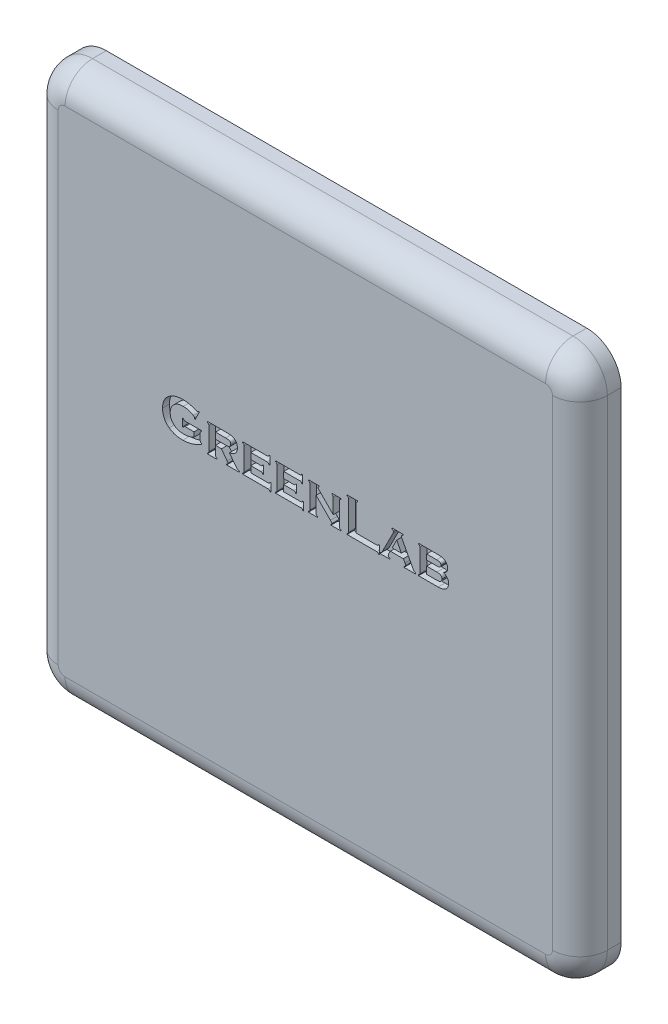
from build123d import *

# Parameters (mm, degrees)
SKETCH1_W           = 40
SKETCH1_H           = 40
BOSS_EXTRUDE1_DEPTH = 3
FILLET1_R           = 2.5
FILLET2_R           = 2
CUT_EXTRUDE1_DEPTH  = 0.5


with BuildPart() as part:
    # Sketch1 → Boss-Extrude1 (new body)
    with BuildSketch(Plane.XY.offset(3)):
        with Locations((-2.5, -2.5)):
            Rectangle(SKETCH1_W, SKETCH1_H)
    extrude(amount=-BOSS_EXTRUDE1_DEPTH)

    # Fillet1
    fillet1_edges = [part.edges().sort_by_distance(p)[0] for p in [
        (-22.5, -22.5, 1.5),
        (-22.5, 17.5, 1.5),
        (17.5, 17.5, 1.5),
        (17.5, -22.5, 1.5),
    ]]
    fillet(fillet1_edges, radius=FILLET1_R)

    # Fillet2
    fillet2_edges = [part.edges().sort_by_distance(p)[0] for p in [
        (-2.5, 17.5, 3),
        (-2.5, -22.5, 3),
        (17.5, -2.5, 3),
        (-22.5, -2.5, 3),
        (16.767766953, -21.767766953, 3),
        (-21.767766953, -21.767766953, 3),
        (16.767766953, 16.767766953, 3),
        (-21.767766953, 16.767766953, 3),
    ]]
    fillet(fillet2_edges, radius=FILLET2_R)

    # Sketch2 → Cut-Extrude1 (cut)
    # profile 1 of 8: a face of its own
    with BuildSketch(Plane.XY.offset(3)):
        with BuildLine():
            Line((-10.607638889, -0.347222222), (-11.236979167, -0.347222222))
            add(Edge.make_bspline(
                [(-11.236979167, -0.347222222), (-11.246019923, -0.347634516), (-11.263102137, -0.34841353), (-11.287347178, -0.35149615), (-11.307491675, -0.359463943), (-11.324959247, -0.369292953), (-11.338890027, -0.38393915), (-11.351469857, -0.402230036), (-11.362777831, -0.425071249), (-11.36849343, -0.442262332), (-11.371527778, -0.451388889)],
                knots=[0, 0, 0, 0, 1.161951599, 2.195469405, 3.113157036, 3.92473158, 4.744880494, 5.677977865, 6.767264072, 8, 8, 8, 8], degree=3))
            Line((-11.371527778, -0.451388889), (-11.440972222, -0.451388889))
            Line((-11.440972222, -0.451388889), (-11.440972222, 0.104166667))
            Line((-11.440972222, 0.104166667), (-11.371527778, 0.104166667))
            add(Edge.make_bspline(
                [(-11.371527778, 0.104166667), (-11.368544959, 0.094831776), (-11.36297233, 0.077391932), (-11.351170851, 0.054602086), (-11.33964868, 0.03555398), (-11.325666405, 0.021148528), (-11.308569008, 0.011661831), (-11.288872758, 0.00441836), (-11.265290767, 0.001141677), (-11.24855745, 0.000395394), (-11.23969184, 0)],
                knots=[0, 0, 0, 0, 1.267174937, 2.367390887, 3.316236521, 4.144614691, 4.932227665, 5.829021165, 6.8497767, 8, 8, 8, 8], degree=3))
            Line((-11.23969184, 0), (-10.052083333, 0))
            Line((-10.052083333, 0), (-10.052083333, -0.069444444))
            add(Edge.make_bspline(
                [(-10.052083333, -0.069444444), (-10.061041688, -0.072276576), (-10.077879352, -0.077599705), (-10.100257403, -0.088767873), (-10.118962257, -0.100221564), (-10.133298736, -0.113946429), (-10.144193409, -0.129700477), (-10.150911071, -0.14859326), (-10.155417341, -0.170325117), (-10.155959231, -0.185880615), (-10.15625, -0.194227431)],
                knots=[0, 0, 0, 0, 1.261989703, 2.371971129, 3.357346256, 4.200586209, 5.023932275, 5.909634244, 6.878345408, 8, 8, 8, 8], degree=3))
            Line((-10.15625, -0.194227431), (-10.15625, -0.673828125))
            add(Edge.make_bspline(
                [(-10.15625, -0.673828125), (-10.155889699, -0.682161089), (-10.155219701, -0.697656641), (-10.151544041, -0.719691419), (-10.144732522, -0.738581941), (-10.134437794, -0.754788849), (-10.120144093, -0.76839035), (-10.101054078, -0.779314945), (-10.078418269, -0.790471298), (-10.061224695, -0.795785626), (-10.052083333, -0.798611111)],
                knots=[0, 0, 0, 0, 1.116533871, 2.076248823, 2.980572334, 3.786808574, 4.626198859, 5.59413096, 6.720864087, 8, 8, 8, 8], degree=3))
            Line((-10.052083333, -0.798611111), (-10.052083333, -0.868055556))
            add(Edge.make_bspline(
                [(-10.052083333, -0.868055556), (-10.110666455, -0.901306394), (-10.225820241, -0.966665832), (-10.402088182, -1.051148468), (-10.5768336, -1.123083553), (-10.750217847, -1.181933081), (-10.922179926, -1.22792273), (-11.092791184, -1.26040836), (-11.262157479, -1.280912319), (-11.374726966, -1.283457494), (-11.430664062, -1.284722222)],
                knots=[0, 0, 0, 0, 1.109239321, 2.180373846, 3.216973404, 4.220153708, 5.194106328, 6.146335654, 7.078892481, 8, 8, 8, 8], degree=3))
            add(Edge.make_bspline(
                [(-11.430664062, -1.284722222), (-11.480070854, -1.283992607), (-11.576548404, -1.282567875), (-11.717712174, -1.26841923), (-11.852032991, -1.246781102), (-11.979198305, -1.214926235), (-12.100077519, -1.175751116), (-12.213379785, -1.12610841), (-12.320263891, -1.068197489), (-12.385929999, -1.022231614), (-12.418619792, -0.999348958)],
                knots=[0, 0, 0, 0, 1.133031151, 2.212490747, 3.251195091, 4.25132316, 5.216867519, 6.162529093, 7.085273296, 8, 8, 8, 8], degree=3))
            add(Edge.make_bspline(
                [(-12.418619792, -0.999348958), (-12.438124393, -0.984168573), (-12.476843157, -0.954033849), (-12.531627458, -0.905928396), (-12.582161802, -0.855026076), (-12.629550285, -0.802718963), (-12.67259339, -0.747401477), (-12.711973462, -0.690094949), (-12.748171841, -0.630940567), (-12.779424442, -0.569179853), (-12.80797848, -0.505624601), (-12.832178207, -0.439559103), (-12.852729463, -0.371389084), (-12.870474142, -0.301271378), (-12.883184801, -0.228693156), (-12.892260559, -0.153891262), (-12.898679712, -0.077151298), (-12.899095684, -0.025150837), (-12.899305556, 0.001085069)],
                knots=[0, 0, 0, 0, 1.027594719, 2.039887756, 3.02889878, 4.008719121, 4.97294883, 5.940778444, 6.898978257, 7.854104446, 8.816896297, 9.794723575, 10.777166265, 11.776613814, 12.800294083, 13.838400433, 14.909403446, 16, 16, 16, 16], degree=3))
            add(Edge.make_bspline(
                [(-12.899305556, 0.001085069), (-12.898163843, 0.049624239), (-12.895933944, 0.144426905), (-12.875311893, 0.2828534), (-12.841722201, 0.41361329), (-12.795190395, 0.537141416), (-12.734124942, 0.652470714), (-12.660674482, 0.760529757), (-12.573195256, 0.860943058), (-12.505960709, 0.919974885), (-12.471788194, 0.949978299)],
                knots=[0, 0, 0, 0, 1.080618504, 2.110574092, 3.109061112, 4.08310081, 5.043468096, 6.008781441, 6.987946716, 8, 8, 8, 8], degree=3))
            add(Edge.make_bspline(
                [(-12.471788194, 0.949978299), (-12.437269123, 0.977010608), (-12.367919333, 1.031319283), (-12.252786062, 1.098570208), (-12.130135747, 1.156516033), (-11.998958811, 1.203687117), (-11.859427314, 1.239848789), (-11.711752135, 1.265688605), (-11.555798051, 1.281667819), (-11.448968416, 1.28368846), (-11.394314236, 1.284722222)],
                knots=[0, 0, 0, 0, 0.913103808, 1.834451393, 2.772129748, 3.738097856, 4.735733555, 5.773315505, 6.860825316, 8, 8, 8, 8], degree=3))
            add(Edge.make_bspline(
                [(-11.394314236, 1.284722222), (-11.359221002, 1.284112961), (-11.290049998, 1.282912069), (-11.187866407, 1.276048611), (-11.088838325, 1.263397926), (-10.991005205, 1.245834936), (-10.891504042, 1.221898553), (-10.786896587, 1.191809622), (-10.675981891, 1.154967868), (-10.600485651, 1.126398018), (-10.561523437, 1.111653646)],
                knots=[0, 0, 0, 0, 0.983904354, 1.939338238, 2.869415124, 3.781350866, 4.72455948, 5.737149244, 6.832184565, 8, 8, 8, 8], degree=3))
            add(Edge.make_bspline(
                [(-10.561523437, 1.111653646), (-10.542421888, 1.104222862), (-10.507378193, 1.090590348), (-10.458763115, 1.074748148), (-10.418882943, 1.064487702), (-10.395004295, 1.062571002), (-10.384657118, 1.061740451)],
                knots=[0, 0, 0, 0, 1.33242011, 2.444457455, 3.325947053, 4, 4, 4, 4], degree=3))
            add(Edge.make_bspline(
                [(-10.384657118, 1.061740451), (-10.37789614, 1.062329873), (-10.363399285, 1.063593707), (-10.341685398, 1.072586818), (-10.318394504, 1.085933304), (-10.303311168, 1.097688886), (-10.295138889, 1.10405816)],
                knots=[0, 0, 0, 0, 0.80452628, 1.72506123, 2.767418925, 4, 4, 4, 4], degree=3))
            Line((-10.295138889, 1.10405816), (-10.225694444, 1.076388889))
            Line((-10.225694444, 1.076388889), (-10.520833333, 0.477430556))
            Line((-10.520833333, 0.477430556), (-10.574001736, 0.505642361))
            add(Edge.make_bspline(
                [(-10.574001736, 0.505642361), (-10.574303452, 0.515250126), (-10.574858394, 0.53292155), (-10.579026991, 0.557160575), (-10.583484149, 0.577292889), (-10.590167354, 0.594498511), (-10.601350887, 0.609467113), (-10.615250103, 0.625852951), (-10.634663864, 0.64292875), (-10.649183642, 0.654545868), (-10.657009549, 0.660807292)],
                knots=[0, 0, 0, 0, 1.244331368, 2.288680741, 3.181265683, 3.916936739, 4.658188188, 5.588746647, 6.700376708, 8, 8, 8, 8], degree=3))
            add(Edge.make_bspline(
                [(-10.657009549, 0.660807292), (-10.677704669, 0.675012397), (-10.721692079, 0.705205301), (-10.798225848, 0.743529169), (-10.887995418, 0.777376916), (-10.987614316, 0.808613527), (-11.092124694, 0.834707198), (-11.196489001, 0.853755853), (-11.29800503, 0.865740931), (-11.364805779, 0.867293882), (-11.397569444, 0.868055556)],
                knots=[0, 0, 0, 0, 0.772448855, 1.64183753, 2.627606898, 3.725128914, 4.855858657, 5.942928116, 6.991070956, 8, 8, 8, 8], degree=3))
            add(Edge.make_bspline(
                [(-11.397569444, 0.868055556), (-11.429789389, 0.867506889), (-11.492775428, 0.866434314), (-11.585311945, 0.855766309), (-11.673499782, 0.838592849), (-11.757798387, 0.814661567), (-11.837574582, 0.783836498), (-11.913144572, 0.7458094), (-11.985140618, 0.701918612), (-12.028900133, 0.666554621), (-12.05078125, 0.648871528)],
                knots=[0, 0, 0, 0, 1.098368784, 2.14717621, 3.171603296, 4.15934231, 5.131674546, 6.083189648, 7.041535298, 8, 8, 8, 8], degree=3))
            add(Edge.make_bspline(
                [(-12.05078125, 0.648871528), (-12.074285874, 0.62788857), (-12.120495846, 0.58663618), (-12.179919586, 0.516055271), (-12.230560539, 0.441157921), (-12.272321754, 0.361166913), (-12.304401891, 0.276060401), (-12.32687576, 0.185921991), (-12.341700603, 0.09109294), (-12.343057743, 0.026099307), (-12.34375, -0.007052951)],
                knots=[0, 0, 0, 0, 1.016795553, 1.999014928, 2.971244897, 3.932867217, 4.907271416, 5.901990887, 6.92983762, 8, 8, 8, 8], degree=3))
            add(Edge.make_bspline(
                [(-12.34375, -0.007052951), (-12.343027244, -0.039300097), (-12.34161552, -0.102286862), (-12.327287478, -0.194381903), (-12.305662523, -0.281931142), (-12.273562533, -0.364534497), (-12.233608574, -0.442507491), (-12.183783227, -0.515299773), (-12.12613185, -0.584302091), (-12.080802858, -0.624636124), (-12.057834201, -0.645073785)],
                knots=[0, 0, 0, 0, 1.069643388, 2.089281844, 3.086639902, 4.057689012, 5.02427436, 5.988321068, 6.980662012, 8, 8, 8, 8], degree=3))
            add(Edge.make_bspline(
                [(-12.057834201, -0.645073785), (-12.035565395, -0.66289434), (-11.990831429, -0.698692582), (-11.917196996, -0.744305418), (-11.838000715, -0.782097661), (-11.754216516, -0.813760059), (-11.66521899, -0.838245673), (-11.570966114, -0.855186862), (-11.471633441, -0.866595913), (-11.403570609, -0.867562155), (-11.368815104, -0.868055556)],
                knots=[0, 0, 0, 0, 0.924808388, 1.857771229, 2.80254234, 3.768129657, 4.760342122, 5.792672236, 6.872853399, 8, 8, 8, 8], degree=3))
            add(Edge.make_bspline(
                [(-11.368815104, -0.868055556), (-11.334259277, -0.867328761), (-11.265223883, -0.865876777), (-11.161897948, -0.857261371), (-11.059468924, -0.841751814), (-10.958511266, -0.821473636), (-10.861401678, -0.795732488), (-10.769900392, -0.765568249), (-10.685549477, -0.730503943), (-10.633135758, -0.702960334), (-10.607638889, -0.689561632)],
                knots=[0, 0, 0, 0, 1.05048524, 2.098652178, 3.148964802, 4.19795309, 5.227341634, 6.200829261, 7.124785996, 8, 8, 8, 8], degree=3))
            Line((-10.607638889, -0.689561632), (-10.607638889, -0.347222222))
        make_face()
    # profile 2 of 8: a face of its own
    with BuildSketch(Plane.XY.offset(3)):
        with BuildLine():
            Line((-9.045138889, -0.416666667), (-9.045138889, -1.048177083))
            add(Edge.make_bspline(
                [(-9.045138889, -1.048177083), (-9.044839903, -1.0568801), (-9.044281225, -1.073142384), (-9.039846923, -1.095995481), (-9.032938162, -1.115684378), (-9.023033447, -1.132897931), (-9.008225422, -1.146977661), (-8.989947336, -1.159747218), (-8.967080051, -1.171315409), (-8.950096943, -1.177326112), (-8.940972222, -1.180555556)],
                knots=[0, 0, 0, 0, 1.132768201, 2.116668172, 3.018181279, 3.842213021, 4.674950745, 5.655178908, 6.740169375, 8, 8, 8, 8], degree=3))
            Line((-8.940972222, -1.180555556), (-8.940972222, -1.25))
            Line((-8.940972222, -1.25), (-9.635416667, -1.25))
            Line((-9.635416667, -1.25), (-9.635416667, -1.180555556))
            add(Edge.make_bspline(
                [(-9.635416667, -1.180555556), (-9.626472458, -1.177700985), (-9.609661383, -1.172335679), (-9.587153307, -1.161465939), (-9.568820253, -1.149034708), (-9.55447955, -1.134320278), (-9.543995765, -1.116821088), (-9.536416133, -1.09662627), (-9.532154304, -1.073126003), (-9.531564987, -1.056513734), (-9.53125, -1.047634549)],
                knots=[0, 0, 0, 0, 1.214843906, 2.283358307, 3.225537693, 4.070394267, 4.922042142, 5.848661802, 6.850119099, 8, 8, 8, 8], degree=3))
            Line((-9.53125, -1.047634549), (-9.53125, 0.59624566))
            add(Edge.make_bspline(
                [(-9.53125, 0.59624566), (-9.531680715, 0.604919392), (-9.532501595, 0.621450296), (-9.535379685, 0.64488467), (-9.54376477, 0.664293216), (-9.55327372, 0.681553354), (-9.568135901, 0.6953932), (-9.586043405, 0.708696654), (-9.609231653, 0.719741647), (-9.626318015, 0.725891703), (-9.635416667, 0.729166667)],
                knots=[0, 0, 0, 0, 1.128472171, 2.1507081, 3.035212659, 3.856119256, 4.685698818, 5.643135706, 6.74494729, 8, 8, 8, 8], degree=3))
            Line((-9.635416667, 0.729166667), (-9.635416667, 0.798611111))
            Line((-9.635416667, 0.798611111), (-8.305121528, 0.798611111))
            add(Edge.make_bspline(
                [(-8.305121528, 0.798611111), (-8.264428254, 0.798319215), (-8.188252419, 0.797772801), (-8.081604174, 0.793316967), (-7.990562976, 0.784663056), (-7.91265521, 0.773630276), (-7.844214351, 0.757407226), (-7.781290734, 0.736400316), (-7.721930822, 0.7097724), (-7.685338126, 0.687594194), (-7.667100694, 0.676540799)],
                knots=[0, 0, 0, 0, 1.48188809, 2.77402262, 3.885406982, 4.811191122, 5.637019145, 6.442966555, 7.223990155, 8, 8, 8, 8], degree=3))
            add(Edge.make_bspline(
                [(-7.667100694, 0.676540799), (-7.649512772, 0.664205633), (-7.614727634, 0.639809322), (-7.569915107, 0.594520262), (-7.532309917, 0.543526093), (-7.501059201, 0.487256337), (-7.477218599, 0.425103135), (-7.459891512, 0.357414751), (-7.449527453, 0.283885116), (-7.448464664, 0.232962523), (-7.447916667, 0.206705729)],
                knots=[0, 0, 0, 0, 0.949876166, 1.878651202, 2.806113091, 3.748939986, 4.72015234, 5.745812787, 6.837692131, 8, 8, 8, 8], degree=3))
            add(Edge.make_bspline(
                [(-7.447916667, 0.206705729), (-7.448315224, 0.186614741), (-7.449093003, 0.147407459), (-7.455673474, 0.090219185), (-7.466568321, 0.036559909), (-7.48090752, -0.014020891), (-7.500835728, -0.060657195), (-7.523983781, -0.104677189), (-7.552390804, -0.144664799), (-7.584833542, -0.181705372), (-7.622234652, -0.215345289), (-7.664203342, -0.247287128), (-7.712018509, -0.27549296), (-7.764713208, -0.301929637), (-7.822723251, -0.325390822), (-7.88582309, -0.347290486), (-7.954399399, -0.366137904), (-8.002153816, -0.376563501), (-8.026801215, -0.381944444)],
                knots=[0, 0, 0, 0, 1.054974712, 2.05876829, 3.018077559, 3.928757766, 4.81427522, 5.67693176, 6.535972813, 7.383915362, 8.257948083, 9.17356801, 10.149288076, 11.168732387, 12.267602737, 13.433048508, 14.67512408, 16, 16, 16, 16], degree=3))
            Line((-8.026801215, -0.381944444), (-7.629665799, -0.917426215))
            add(Edge.make_bspline(
                [(-7.629665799, -0.917426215), (-7.612699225, -0.939841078), (-7.581321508, -0.981294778), (-7.535022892, -1.036046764), (-7.495152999, -1.08021234), (-7.458813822, -1.113682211), (-7.42381081, -1.139052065), (-7.387236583, -1.157179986), (-7.349391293, -1.172659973), (-7.32253571, -1.177913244), (-7.309027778, -1.180555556)],
                knots=[0, 0, 0, 0, 1.583031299, 2.927633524, 4.037651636, 4.931799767, 5.706188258, 6.462410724, 7.226616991, 8, 8, 8, 8], degree=3))
            Line((-7.309027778, -1.180555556), (-7.309027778, -1.25))
            Line((-7.309027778, -1.25), (-8.234049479, -1.25))
            Line((-8.234049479, -1.25), (-8.234049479, -1.180555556))
            add(Edge.make_bspline(
                [(-8.234049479, -1.180555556), (-8.219265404, -1.17654565), (-8.19281664, -1.169371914), (-8.161254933, -1.150741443), (-8.13815299, -1.128847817), (-8.13586342, -1.110258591), (-8.134765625, -1.101345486)],
                knots=[0, 0, 0, 0, 1.339679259, 2.396691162, 3.231250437, 4, 4, 4, 4], degree=3))
            add(Edge.make_bspline(
                [(-8.134765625, -1.101345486), (-8.135664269, -1.093828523), (-8.137743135, -1.076439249), (-8.15144713, -1.049381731), (-8.170939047, -1.017140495), (-8.188186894, -0.995183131), (-8.197699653, -0.983072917)],
                knots=[0, 0, 0, 0, 0.664601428, 1.537447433, 2.641820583, 4, 4, 4, 4], degree=3))
            Line((-8.197699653, -0.983072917), (-8.606228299, -0.416666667))
            Line((-8.606228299, -0.416666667), (-9.045138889, -0.416666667))
        make_face()
        with BuildLine():
            Line((-9.045138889, -0.034722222), (-8.299696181, -0.034722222))
            add(Edge.make_bspline(
                [(-8.299696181, -0.034722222), (-8.273260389, -0.03447032), (-8.223897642, -0.033999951), (-8.15548393, -0.026461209), (-8.097284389, -0.017240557), (-8.063741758, -0.004639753), (-8.048502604, 0.001085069)],
                knots=[0, 0, 0, 0, 1.241949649, 2.3190547, 3.236309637, 4, 4, 4, 4], degree=3))
            add(Edge.make_bspline(
                [(-8.048502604, 0.001085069), (-8.039491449, 0.005346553), (-8.021891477, 0.013669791), (-7.998474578, 0.030318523), (-7.977598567, 0.049152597), (-7.962300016, 0.072530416), (-7.949364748, 0.097897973), (-7.94027173, 0.126259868), (-7.93471992, 0.157659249), (-7.934265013, 0.179554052), (-7.934027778, 0.190972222)],
                knots=[0, 0, 0, 0, 1.008207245, 1.969161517, 2.902631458, 3.838078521, 4.780680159, 5.783374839, 6.844026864, 8, 8, 8, 8], degree=3))
            add(Edge.make_bspline(
                [(-7.934027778, 0.190972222), (-7.934749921, 0.210628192), (-7.936100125, 0.247379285), (-7.951519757, 0.297767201), (-7.976937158, 0.339090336), (-8.007998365, 0.363978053), (-8.036935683, 0.379536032), (-8.063166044, 0.389166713), (-8.092860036, 0.397832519), (-8.126793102, 0.404791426), (-8.164490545, 0.410086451), (-8.206152, 0.413651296), (-8.251547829, 0.416703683), (-8.283233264, 0.416679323), (-8.299696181, 0.416666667)],
                knots=[0, 0, 0, 0, 1.425592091, 2.665453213, 3.789359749, 4.900959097, 5.513024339, 6.175067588, 6.928547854, 7.761851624, 8.692003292, 9.695964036, 10.802883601, 12, 12, 12, 12], degree=3))
            Line((-8.299696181, 0.416666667), (-9.045138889, 0.416666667))
            Line((-9.045138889, 0.416666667), (-9.045138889, -0.034722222))
        make_face(mode=Mode.SUBTRACT)
    # profile 3 of 8: a face of its own
    with BuildSketch(Plane.XY.offset(3)):
        with BuildLine():
            Line((-6.475694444, -0.416666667), (-6.475694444, -0.868055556))
            Line((-6.475694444, -0.868055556), (-5.217556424, -0.868055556))
            add(Edge.make_bspline(
                [(-5.217556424, -0.868055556), (-5.208863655, -0.867687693), (-5.192653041, -0.867001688), (-5.169706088, -0.863422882), (-5.150103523, -0.856551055), (-5.133319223, -0.846130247), (-5.118700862, -0.832059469), (-5.106449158, -0.813190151), (-5.09565496, -0.790085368), (-5.089883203, -0.772999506), (-5.086805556, -0.763888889)],
                knots=[0, 0, 0, 0, 1.135380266, 2.11730133, 3.020893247, 3.826673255, 4.678188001, 5.647254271, 6.745456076, 8, 8, 8, 8], degree=3))
            Line((-5.086805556, -0.763888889), (-5.017361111, -0.763888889))
            Line((-5.017361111, -0.763888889), (-5.017361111, -1.354166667))
            Line((-5.017361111, -1.354166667), (-5.086805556, -1.354166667))
            add(Edge.make_bspline(
                [(-5.086805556, -1.354166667), (-5.089434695, -1.345206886), (-5.094390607, -1.328317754), (-5.105383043, -1.305919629), (-5.117763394, -1.287544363), (-5.132437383, -1.273417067), (-5.149532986, -1.262584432), (-5.169669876, -1.255198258), (-5.19296558, -1.250928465), (-5.209399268, -1.25032138), (-5.218098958, -1.25)],
                knots=[0, 0, 0, 0, 1.215074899, 2.290408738, 3.23860127, 4.08884986, 4.925925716, 5.858459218, 6.866307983, 8, 8, 8, 8], degree=3))
            Line((-5.218098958, -1.25), (-7.065972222, -1.25))
            Line((-7.065972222, -1.25), (-7.065972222, -1.180555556))
            add(Edge.make_bspline(
                [(-7.065972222, -1.180555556), (-7.057028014, -1.177700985), (-7.040216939, -1.172335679), (-7.017708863, -1.161465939), (-6.999375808, -1.149034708), (-6.985035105, -1.134320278), (-6.974551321, -1.116821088), (-6.966971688, -1.09662627), (-6.96270986, -1.073126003), (-6.962120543, -1.056513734), (-6.961805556, -1.047634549)],
                knots=[0, 0, 0, 0, 1.214843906, 2.283358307, 3.225537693, 4.070394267, 4.922042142, 5.848661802, 6.850119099, 8, 8, 8, 8], degree=3))
            Line((-6.961805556, -1.047634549), (-6.961805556, 0.59624566))
            add(Edge.make_bspline(
                [(-6.961805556, 0.59624566), (-6.96223627, 0.604919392), (-6.963057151, 0.621450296), (-6.96593524, 0.64488467), (-6.974320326, 0.664293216), (-6.983829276, 0.681553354), (-6.998691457, 0.6953932), (-7.016598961, 0.708696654), (-7.039787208, 0.719741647), (-7.056873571, 0.725891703), (-7.065972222, 0.729166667)],
                knots=[0, 0, 0, 0, 1.128472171, 2.1507081, 3.035212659, 3.856119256, 4.685698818, 5.643135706, 6.74494729, 8, 8, 8, 8], degree=3))
            Line((-7.065972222, 0.729166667), (-7.065972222, 0.798611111))
            Line((-7.065972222, 0.798611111), (-5.288085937, 0.798611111))
            add(Edge.make_bspline(
                [(-5.288085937, 0.798611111), (-5.279203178, 0.798915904), (-5.262584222, 0.799486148), (-5.239357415, 0.803830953), (-5.219458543, 0.810782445), (-5.202290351, 0.82090019), (-5.187598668, 0.835164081), (-5.175521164, 0.853912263), (-5.164328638, 0.87660099), (-5.159070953, 0.893637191), (-5.15625, 0.902777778)],
                knots=[0, 0, 0, 0, 1.152879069, 2.156947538, 3.05581166, 3.877422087, 4.724481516, 5.688477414, 6.75977783, 8, 8, 8, 8], degree=3))
            Line((-5.15625, 0.902777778), (-5.086805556, 0.902777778))
            Line((-5.086805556, 0.902777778), (-5.086805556, 0.3125))
            Line((-5.086805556, 0.3125), (-5.15625, 0.3125))
            add(Edge.make_bspline(
                [(-5.15625, 0.3125), (-5.159115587, 0.321616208), (-5.164505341, 0.338762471), (-5.175190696, 0.361749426), (-5.187799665, 0.380142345), (-5.202246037, 0.394458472), (-5.219460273, 0.404186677), (-5.238915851, 0.412525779), (-5.262335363, 0.415418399), (-5.2788685, 0.416237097), (-5.287543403, 0.416666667)],
                knots=[0, 0, 0, 0, 1.242738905, 2.33741155, 3.283964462, 4.132742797, 4.956020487, 5.843079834, 6.86826837, 8, 8, 8, 8], degree=3))
            Line((-5.287543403, 0.416666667), (-6.475694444, 0.416666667))
            Line((-6.475694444, 0.416666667), (-6.475694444, -0.034722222))
            Line((-6.475694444, -0.034722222), (-5.738389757, -0.034722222))
            add(Edge.make_bspline(
                [(-5.738389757, -0.034722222), (-5.729868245, -0.034409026), (-5.713788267, -0.03381803), (-5.691283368, -0.029499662), (-5.6718834, -0.022577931), (-5.655244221, -0.012251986), (-5.640581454, 0.001797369), (-5.628587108, 0.020705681), (-5.616820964, 0.043291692), (-5.610848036, 0.060304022), (-5.607638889, 0.069444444)],
                knots=[0, 0, 0, 0, 1.117968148, 2.109590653, 2.995889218, 3.806125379, 4.662349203, 5.636774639, 6.730281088, 8, 8, 8, 8], degree=3))
            Line((-5.607638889, 0.069444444), (-5.538194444, 0.069444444))
            Line((-5.538194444, 0.069444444), (-5.538194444, -0.520833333))
            Line((-5.538194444, -0.520833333), (-5.607638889, -0.520833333))
            add(Edge.make_bspline(
                [(-5.607638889, -0.520833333), (-5.610484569, -0.511883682), (-5.615833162, -0.495062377), (-5.626878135, -0.472486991), (-5.638996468, -0.453937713), (-5.653303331, -0.439395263), (-5.670023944, -0.428894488), (-5.689983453, -0.421727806), (-5.713085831, -0.417643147), (-5.729692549, -0.417002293), (-5.738389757, -0.416666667)],
                knots=[0, 0, 0, 0, 1.225527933, 2.303439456, 3.273384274, 4.108798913, 4.947881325, 5.830104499, 6.863590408, 8, 8, 8, 8], degree=3))
            Line((-5.738389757, -0.416666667), (-6.475694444, -0.416666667))
        make_face()
    # profile 4 of 8: a face of its own
    with BuildSketch(Plane.XY.offset(3)):
        with BuildLine():
            Line((-4.079861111, -0.416666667), (-4.079861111, -0.868055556))
            Line((-4.079861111, -0.868055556), (-2.82172309, -0.868055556))
            add(Edge.make_bspline(
                [(-2.82172309, -0.868055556), (-2.813030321, -0.867687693), (-2.796819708, -0.867001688), (-2.773872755, -0.863422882), (-2.75427019, -0.856551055), (-2.73748589, -0.846130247), (-2.722867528, -0.832059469), (-2.710615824, -0.813190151), (-2.699821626, -0.790085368), (-2.69404987, -0.772999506), (-2.690972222, -0.763888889)],
                knots=[0, 0, 0, 0, 1.135380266, 2.11730133, 3.020893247, 3.826673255, 4.678188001, 5.647254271, 6.745456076, 8, 8, 8, 8], degree=3))
            Line((-2.690972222, -0.763888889), (-2.621527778, -0.763888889))
            Line((-2.621527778, -0.763888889), (-2.621527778, -1.354166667))
            Line((-2.621527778, -1.354166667), (-2.690972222, -1.354166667))
            add(Edge.make_bspline(
                [(-2.690972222, -1.354166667), (-2.693601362, -1.345206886), (-2.698557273, -1.328317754), (-2.70954971, -1.305919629), (-2.72193006, -1.287544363), (-2.73660405, -1.273417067), (-2.753699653, -1.262584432), (-2.773836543, -1.255198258), (-2.797132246, -1.250928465), (-2.813565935, -1.25032138), (-2.822265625, -1.25)],
                knots=[0, 0, 0, 0, 1.215074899, 2.290408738, 3.23860127, 4.08884986, 4.925925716, 5.858459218, 6.866307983, 8, 8, 8, 8], degree=3))
            Line((-2.822265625, -1.25), (-4.670138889, -1.25))
            Line((-4.670138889, -1.25), (-4.670138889, -1.180555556))
            add(Edge.make_bspline(
                [(-4.670138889, -1.180555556), (-4.661194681, -1.177700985), (-4.644383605, -1.172335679), (-4.621875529, -1.161465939), (-4.603542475, -1.149034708), (-4.589201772, -1.134320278), (-4.578717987, -1.116821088), (-4.571138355, -1.09662627), (-4.566876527, -1.073126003), (-4.56628721, -1.056513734), (-4.565972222, -1.047634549)],
                knots=[0, 0, 0, 0, 1.214843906, 2.283358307, 3.225537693, 4.070394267, 4.922042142, 5.848661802, 6.850119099, 8, 8, 8, 8], degree=3))
            Line((-4.565972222, -1.047634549), (-4.565972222, 0.59624566))
            add(Edge.make_bspline(
                [(-4.565972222, 0.59624566), (-4.566402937, 0.604919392), (-4.567223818, 0.621450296), (-4.570101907, 0.64488467), (-4.578486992, 0.664293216), (-4.587995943, 0.681553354), (-4.602858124, 0.6953932), (-4.620765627, 0.708696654), (-4.643953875, 0.719741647), (-4.661040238, 0.725891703), (-4.670138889, 0.729166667)],
                knots=[0, 0, 0, 0, 1.128472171, 2.1507081, 3.035212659, 3.856119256, 4.685698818, 5.643135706, 6.74494729, 8, 8, 8, 8], degree=3))
            Line((-4.670138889, 0.729166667), (-4.670138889, 0.798611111))
            Line((-4.670138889, 0.798611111), (-2.892252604, 0.798611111))
            add(Edge.make_bspline(
                [(-2.892252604, 0.798611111), (-2.883369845, 0.798915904), (-2.866750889, 0.799486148), (-2.843524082, 0.803830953), (-2.82362521, 0.810782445), (-2.806457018, 0.82090019), (-2.791765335, 0.835164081), (-2.779687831, 0.853912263), (-2.768495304, 0.87660099), (-2.76323762, 0.893637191), (-2.760416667, 0.902777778)],
                knots=[0, 0, 0, 0, 1.152879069, 2.156947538, 3.05581166, 3.877422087, 4.724481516, 5.688477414, 6.75977783, 8, 8, 8, 8], degree=3))
            Line((-2.760416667, 0.902777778), (-2.690972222, 0.902777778))
            Line((-2.690972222, 0.902777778), (-2.690972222, 0.3125))
            Line((-2.690972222, 0.3125), (-2.760416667, 0.3125))
            add(Edge.make_bspline(
                [(-2.760416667, 0.3125), (-2.763282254, 0.321616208), (-2.768672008, 0.338762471), (-2.779357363, 0.361749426), (-2.791966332, 0.380142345), (-2.806412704, 0.394458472), (-2.823626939, 0.404186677), (-2.843082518, 0.412525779), (-2.86650203, 0.415418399), (-2.883035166, 0.416237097), (-2.891710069, 0.416666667)],
                knots=[0, 0, 0, 0, 1.242738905, 2.33741155, 3.283964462, 4.132742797, 4.956020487, 5.843079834, 6.86826837, 8, 8, 8, 8], degree=3))
            Line((-2.891710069, 0.416666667), (-4.079861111, 0.416666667))
            Line((-4.079861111, 0.416666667), (-4.079861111, -0.034722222))
            Line((-4.079861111, -0.034722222), (-3.342556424, -0.034722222))
            add(Edge.make_bspline(
                [(-3.342556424, -0.034722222), (-3.334034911, -0.034409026), (-3.317954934, -0.03381803), (-3.295450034, -0.029499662), (-3.276050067, -0.022577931), (-3.259410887, -0.012251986), (-3.244748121, 0.001797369), (-3.232753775, 0.020705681), (-3.220987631, 0.043291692), (-3.215014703, 0.060304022), (-3.211805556, 0.069444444)],
                knots=[0, 0, 0, 0, 1.117968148, 2.109590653, 2.995889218, 3.806125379, 4.662349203, 5.636774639, 6.730281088, 8, 8, 8, 8], degree=3))
            Line((-3.211805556, 0.069444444), (-3.142361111, 0.069444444))
            Line((-3.142361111, 0.069444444), (-3.142361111, -0.520833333))
            Line((-3.142361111, -0.520833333), (-3.211805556, -0.520833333))
            add(Edge.make_bspline(
                [(-3.211805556, -0.520833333), (-3.214651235, -0.511883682), (-3.219999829, -0.495062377), (-3.231044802, -0.472486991), (-3.243163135, -0.453937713), (-3.257469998, -0.439395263), (-3.274190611, -0.428894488), (-3.29415012, -0.421727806), (-3.317252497, -0.417643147), (-3.333859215, -0.417002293), (-3.342556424, -0.416666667)],
                knots=[0, 0, 0, 0, 1.225527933, 2.303439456, 3.273384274, 4.108798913, 4.947881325, 5.830104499, 6.863590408, 8, 8, 8, 8], degree=3))
            Line((-3.342556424, -0.416666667), (-4.079861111, -0.416666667))
        make_face()
    # profile 5 of 8: a face of its own
    with BuildSketch(Plane.XY.offset(3)):
        with BuildLine():
            Line((-1.71875, 0.093858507), (-1.71875, -1.046006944))
            add(Edge.make_bspline(
                [(-1.71875, -1.046006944), (-1.718455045, -1.054893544), (-1.717903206, -1.071519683), (-1.713405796, -1.094867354), (-1.706680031, -1.115310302), (-1.695873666, -1.132883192), (-1.681402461, -1.147818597), (-1.662721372, -1.160319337), (-1.640404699, -1.171849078), (-1.623541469, -1.177535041), (-1.614583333, -1.180555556)],
                knots=[0, 0, 0, 0, 1.143670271, 2.139718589, 3.053348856, 3.900396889, 4.773630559, 5.710721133, 6.783882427, 8, 8, 8, 8], degree=3))
            Line((-1.614583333, -1.180555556), (-1.614583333, -1.25))
            Line((-1.614583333, -1.25), (-2.274305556, -1.25))
            Line((-2.274305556, -1.25), (-2.274305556, -1.180555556))
            add(Edge.make_bspline(
                [(-2.274305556, -1.180555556), (-2.265361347, -1.177700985), (-2.248550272, -1.172335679), (-2.226042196, -1.161465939), (-2.207709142, -1.149034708), (-2.193368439, -1.134320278), (-2.182884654, -1.116821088), (-2.175305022, -1.09662627), (-2.171043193, -1.073126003), (-2.170453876, -1.056513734), (-2.170138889, -1.047634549)],
                knots=[0, 0, 0, 0, 1.214843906, 2.283358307, 3.225537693, 4.070394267, 4.922042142, 5.848661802, 6.850119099, 8, 8, 8, 8], degree=3))
            Line((-2.170138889, -1.047634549), (-2.170138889, 0.59624566))
            add(Edge.make_bspline(
                [(-2.170138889, 0.59624566), (-2.170569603, 0.604919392), (-2.171390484, 0.621450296), (-2.174268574, 0.64488467), (-2.182653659, 0.664293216), (-2.192162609, 0.681553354), (-2.20702479, 0.6953932), (-2.224932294, 0.708696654), (-2.248120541, 0.719741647), (-2.265206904, 0.725891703), (-2.274305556, 0.729166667)],
                knots=[0, 0, 0, 0, 1.128472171, 2.1507081, 3.035212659, 3.856119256, 4.685698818, 5.643135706, 6.74494729, 8, 8, 8, 8], degree=3))
            Line((-2.274305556, 0.729166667), (-2.274305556, 0.798611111))
            Line((-2.274305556, 0.798611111), (-1.503363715, 0.798611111))
            Line((-1.503363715, 0.798611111), (-1.503363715, 0.729166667))
            add(Edge.make_bspline(
                [(-1.503363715, 0.729166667), (-1.515154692, 0.725709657), (-1.536179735, 0.719545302), (-1.562299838, 0.7041957), (-1.579880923, 0.683665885), (-1.581687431, 0.667239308), (-1.582573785, 0.659179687)],
                knots=[0, 0, 0, 0, 1.287745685, 2.296239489, 3.164058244, 4, 4, 4, 4], degree=3))
            add(Edge.make_bspline(
                [(-1.582573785, 0.659179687), (-1.581684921, 0.651664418), (-1.579743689, 0.635251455), (-1.56770281, 0.610676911), (-1.549532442, 0.584452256), (-1.533655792, 0.567813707), (-1.525065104, 0.558810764)],
                knots=[0, 0, 0, 0, 0.763994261, 1.668524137, 2.738463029, 4, 4, 4, 4], degree=3))
            Line((-1.525065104, 0.558810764), (-0.46875, -0.511067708))
            Line((-0.46875, -0.511067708), (-0.46875, 0.59624566))
            add(Edge.make_bspline(
                [(-0.46875, 0.59624566), (-0.469170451, 0.604923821), (-0.469971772, 0.621463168), (-0.473001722, 0.64500946), (-0.48109932, 0.664736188), (-0.490951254, 0.682110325), (-0.505430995, 0.696484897), (-0.523457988, 0.709812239), (-0.546780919, 0.720234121), (-0.563827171, 0.726060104), (-0.572916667, 0.729166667)],
                knots=[0, 0, 0, 0, 1.125637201, 2.145305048, 3.049360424, 3.868204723, 4.712412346, 5.667443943, 6.756221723, 8, 8, 8, 8], degree=3))
            Line((-0.572916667, 0.729166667), (-0.572916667, 0.798611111))
            Line((-0.572916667, 0.798611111), (0.086805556, 0.798611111))
            Line((0.086805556, 0.798611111), (0.086805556, 0.729166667))
            add(Edge.make_bspline(
                [(0.086805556, 0.729166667), (0.07769139, 0.72610474), (0.060753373, 0.720414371), (0.037736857, 0.709479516), (0.0193493, 0.696682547), (0.004906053, 0.682071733), (-0.005178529, 0.664863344), (-0.012225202, 0.644812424), (-0.016397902, 0.62155179), (-0.017030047, 0.604943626), (-0.017361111, 0.59624566)],
                knots=[0, 0, 0, 0, 1.244751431, 2.313280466, 3.288100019, 4.132968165, 4.952453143, 5.848991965, 6.873482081, 8, 8, 8, 8], degree=3))
            Line((-0.017361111, 0.59624566), (-0.017361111, -1.046006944))
            add(Edge.make_bspline(
                [(-0.017361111, -1.046006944), (-0.017026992, -1.054703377), (-0.016389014, -1.071308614), (-0.012255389, -1.094588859), (-0.005031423, -1.11472442), (0.004745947, -1.132265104), (0.019189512, -1.147071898), (0.038193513, -1.158984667), (0.060488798, -1.171512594), (0.077635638, -1.17740459), (0.086805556, -1.180555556)],
                knots=[0, 0, 0, 0, 1.1214246, 2.141282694, 3.033768, 3.869628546, 4.710676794, 5.667831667, 6.752785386, 8, 8, 8, 8], degree=3))
            Line((0.086805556, -1.180555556), (0.086805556, -1.25))
            Line((0.086805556, -1.25), (-0.631510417, -1.25))
            Line((-0.631510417, -1.25), (-0.631510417, -1.180555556))
            add(Edge.make_bspline(
                [(-0.631510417, -1.180555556), (-0.619959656, -1.177588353), (-0.599133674, -1.172238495), (-0.572785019, -1.158685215), (-0.555532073, -1.138616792), (-0.553736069, -1.1227832), (-0.552842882, -1.114908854)],
                knots=[0, 0, 0, 0, 1.28387963, 2.314830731, 3.161933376, 4, 4, 4, 4], degree=3))
            add(Edge.make_bspline(
                [(-0.552842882, -1.114908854), (-0.554022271, -1.106177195), (-0.556590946, -1.087159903), (-0.572565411, -1.0653674), (-0.590588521, -1.044070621), (-0.611763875, -1.021008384), (-0.639629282, -0.991393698), (-0.660924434, -0.969993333), (-0.672743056, -0.958116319)],
                knots=[0, 0, 0, 0, 0.779058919, 1.696767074, 2.352735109, 3.293916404, 4.498147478, 6, 6, 6, 6], degree=3))
            Line((-0.672743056, -0.958116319), (-1.71875, 0.093858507))
        make_face()
    # profile 6 of 8: a face of its own
    with BuildSketch(Plane.XY.offset(3)):
        with BuildLine():
            Line((1.197916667, -0.833333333), (2.699110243, -0.833333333))
            add(Edge.make_bspline(
                [(2.699110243, -0.833333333), (2.707807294, -0.833008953), (2.724235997, -0.832396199), (2.747167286, -0.828236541), (2.766753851, -0.820996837), (2.783813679, -0.811225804), (2.79792818, -0.796557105), (2.8101063, -0.778076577), (2.821143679, -0.755239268), (2.826811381, -0.738287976), (2.829861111, -0.729166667)],
                knots=[0, 0, 0, 0, 1.13718709, 2.148142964, 3.030969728, 3.85821599, 4.694202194, 5.66481062, 6.743459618, 8, 8, 8, 8], degree=3))
            Line((2.829861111, -0.729166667), (2.899305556, -0.729166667))
            Line((2.899305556, -0.729166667), (2.899305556, -1.354166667))
            Line((2.899305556, -1.354166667), (2.829861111, -1.354166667))
            add(Edge.make_bspline(
                [(2.829861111, -1.354166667), (2.826766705, -1.345069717), (2.820963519, -1.328009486), (2.81043664, -1.304873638), (2.797733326, -1.286739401), (2.783852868, -1.272040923), (2.766621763, -1.262509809), (2.747204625, -1.254131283), (2.723772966, -1.251251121), (2.707241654, -1.250430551), (2.698567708, -1.25)],
                knots=[0, 0, 0, 0, 1.251925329, 2.347834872, 3.295457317, 4.12837309, 4.952581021, 5.840642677, 6.866989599, 8, 8, 8, 8], degree=3))
            Line((2.698567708, -1.25), (0.538194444, -1.25))
            Line((0.538194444, -1.25), (0.538194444, -1.180555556))
            add(Edge.make_bspline(
                [(0.538194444, -1.180555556), (0.547291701, -1.177461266), (0.564352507, -1.171658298), (0.587484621, -1.161130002), (0.605630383, -1.14843106), (0.620292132, -1.13453667), (0.630125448, -1.117060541), (0.637923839, -1.097248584), (0.641240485, -1.073593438), (0.641970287, -1.057041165), (0.642361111, -1.048177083)],
                knots=[0, 0, 0, 0, 1.245049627, 2.334940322, 3.277358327, 4.105699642, 4.925380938, 5.852235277, 6.849827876, 8, 8, 8, 8], degree=3))
            Line((0.642361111, -1.048177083), (0.642361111, 1.048177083))
            add(Edge.make_bspline(
                [(0.642361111, 1.048177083), (0.641962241, 1.057038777), (0.641217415, 1.073586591), (0.638022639, 1.097102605), (0.630021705, 1.116676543), (0.620138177, 1.134012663), (0.605839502, 1.148459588), (0.587450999, 1.161096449), (0.5643629, 1.17166867), (0.547295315, 1.177464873), (0.538194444, 1.180555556)],
                knots=[0, 0, 0, 0, 1.150912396, 2.149147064, 3.054708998, 3.874917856, 4.720532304, 5.663556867, 6.754149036, 8, 8, 8, 8], degree=3))
            Line((0.538194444, 1.180555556), (0.538194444, 1.25))
            Line((0.538194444, 1.25), (1.302083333, 1.25))
            Line((1.302083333, 1.25), (1.302083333, 1.180555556))
            add(Edge.make_bspline(
                [(1.302083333, 1.180555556), (1.292984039, 1.177656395), (1.276098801, 1.172276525), (1.252882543, 1.162033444), (1.234664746, 1.149116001), (1.219992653, 1.134485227), (1.210255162, 1.11688026), (1.20301995, 1.096763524), (1.198856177, 1.073298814), (1.198241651, 1.056512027), (1.197916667, 1.047634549)],
                knots=[0, 0, 0, 0, 1.233044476, 2.288117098, 3.259808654, 4.10196579, 4.938928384, 5.832590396, 6.853793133, 8, 8, 8, 8], degree=3))
            Line((1.197916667, 1.047634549), (1.197916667, -0.833333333))
        make_face()
    # profile 7 of 8: a face of its own
    with BuildSketch(Plane.XY.offset(3)):
        with BuildLine():
            Line((4.639756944, -0.729166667), (3.689778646, -0.729166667))
            Line((3.689778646, -0.729166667), (3.576388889, -0.94780816))
            add(Edge.make_bspline(
                [(3.576388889, -0.94780816), (3.570577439, -0.960204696), (3.559856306, -0.98307419), (3.547782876, -1.016254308), (3.539301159, -1.045039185), (3.538311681, -1.063324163), (3.537868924, -1.071506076)],
                knots=[0, 0, 0, 0, 1.258043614, 2.320875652, 3.2486483, 4, 4, 4, 4], degree=3))
            add(Edge.make_bspline(
                [(3.537868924, -1.071506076), (3.538350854, -1.078408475), (3.539279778, -1.091712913), (3.544619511, -1.1108393), (3.55490056, -1.127715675), (3.569394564, -1.142105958), (3.586870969, -1.155732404), (3.609203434, -1.165505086), (3.634769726, -1.174324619), (3.653372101, -1.178402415), (3.663194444, -1.180555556)],
                knots=[0, 0, 0, 0, 0.910861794, 1.755694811, 2.589696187, 3.483236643, 4.43677035, 5.49240796, 6.675952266, 8, 8, 8, 8], degree=3))
            Line((3.663194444, -1.180555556), (3.663194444, -1.25))
            Line((3.663194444, -1.25), (2.934027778, -1.25))
            Line((2.934027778, -1.25), (2.934027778, -1.180555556))
            add(Edge.make_bspline(
                [(2.934027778, -1.180555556), (2.944933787, -1.178634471), (2.965760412, -1.174965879), (2.99426339, -1.165954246), (3.018478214, -1.154375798), (3.039311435, -1.139559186), (3.057979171, -1.118869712), (3.077231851, -1.092229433), (3.097843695, -1.058174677), (3.111225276, -1.032706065), (3.118489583, -1.018880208)],
                knots=[0, 0, 0, 0, 1.026027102, 1.959349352, 2.761782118, 3.5064187, 4.313045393, 5.332612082, 6.551985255, 8, 8, 8, 8], degree=3))
            Line((3.118489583, -1.018880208), (3.872612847, 0.467122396))
            add(Edge.make_bspline(
                [(3.872612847, 0.467122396), (3.878969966, 0.4805931), (3.891065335, 0.506223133), (3.905131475, 0.544329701), (3.912936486, 0.580194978), (3.914291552, 0.603268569), (3.914930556, 0.614149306)],
                knots=[0, 0, 0, 0, 1.158371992, 2.203976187, 3.153055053, 4, 4, 4, 4], degree=3))
            add(Edge.make_bspline(
                [(3.914930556, 0.614149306), (3.913638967, 0.625991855), (3.911020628, 0.649999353), (3.889677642, 0.682843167), (3.855350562, 0.709427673), (3.827205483, 0.722198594), (3.811848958, 0.729166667)],
                knots=[0, 0, 0, 0, 0.861054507, 1.745550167, 2.769926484, 4, 4, 4, 4], degree=3))
            Line((3.811848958, 0.729166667), (3.811848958, 0.798611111))
            Line((3.811848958, 0.798611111), (4.609375, 0.798611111))
            Line((4.609375, 0.798611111), (4.609375, 0.729166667))
            add(Edge.make_bspline(
                [(4.609375, 0.729166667), (4.594246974, 0.722546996), (4.566138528, 0.710247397), (4.533348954, 0.68115365), (4.512023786, 0.646161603), (4.509659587, 0.620220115), (4.508463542, 0.607096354)],
                knots=[0, 0, 0, 0, 1.167592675, 2.169431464, 3.073918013, 4, 4, 4, 4], degree=3))
            add(Edge.make_bspline(
                [(4.508463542, 0.607096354), (4.508991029, 0.596548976), (4.510107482, 0.57422494), (4.520079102, 0.539467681), (4.533691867, 0.501062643), (4.547007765, 0.475297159), (4.554036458, 0.461697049)],
                knots=[0, 0, 0, 0, 0.821800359, 1.739380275, 2.806749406, 4, 4, 4, 4], degree=3))
            Line((4.554036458, 0.461697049), (5.326605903, -0.979275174))
            add(Edge.make_bspline(
                [(5.326605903, -0.979275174), (5.336633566, -0.997232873), (5.354932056, -1.030002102), (5.381087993, -1.073693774), (5.404536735, -1.106669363), (5.425317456, -1.131422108), (5.447707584, -1.149353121), (5.473996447, -1.161725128), (5.503973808, -1.173871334), (5.526322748, -1.17823669), (5.538194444, -1.180555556)],
                knots=[0, 0, 0, 0, 1.613020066, 2.94344076, 3.990283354, 4.784068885, 5.470665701, 6.219068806, 7.053974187, 8, 8, 8, 8], degree=3))
            Line((5.538194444, -1.180555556), (5.538194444, -1.25))
            Line((5.538194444, -1.25), (4.6875, -1.25))
            Line((4.6875, -1.25), (4.6875, -1.180555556))
            add(Edge.make_bspline(
                [(4.6875, -1.180555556), (4.696778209, -1.178789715), (4.71432341, -1.17545049), (4.738424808, -1.167295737), (4.758902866, -1.157095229), (4.77554808, -1.144306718), (4.78914655, -1.129502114), (4.798221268, -1.111857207), (4.804003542, -1.092303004), (4.804454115, -1.078602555), (4.8046875, -1.071506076)],
                knots=[0, 0, 0, 0, 1.280586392, 2.42160363, 3.442514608, 4.370371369, 5.257057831, 6.146457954, 7.039913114, 8, 8, 8, 8], degree=3))
            add(Edge.make_bspline(
                [(4.8046875, -1.071506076), (4.804129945, -1.061686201), (4.802933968, -1.040622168), (4.793238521, -1.007691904), (4.778677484, -0.971554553), (4.76552331, -0.947144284), (4.758572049, -0.934244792)],
                knots=[0, 0, 0, 0, 0.804870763, 1.726480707, 2.798569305, 4, 4, 4, 4], degree=3))
            Line((4.758572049, -0.934244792), (4.639756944, -0.729166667))
        make_face()
        Polygon((4.494357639, -0.451388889), (4.155815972, 0.203993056), (3.829210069, -0.451388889), align=None, mode=Mode.SUBTRACT)
    # profile 8 of 8: a face of its own
    with BuildSketch(Plane.XY.offset(3)):
        with BuildLine():
            add(Edge.make_bspline(
                [(7.573784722, -0.149739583), (7.597643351, -0.160989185), (7.642611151, -0.18219199), (7.703527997, -0.216984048), (7.754862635, -0.251276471), (7.783442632, -0.276751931), (7.796766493, -0.288628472)],
                knots=[0, 0, 0, 0, 1.199284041, 2.260363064, 3.188989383, 4, 4, 4, 4], degree=3))
            add(Edge.make_bspline(
                [(7.796766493, -0.288628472), (7.807685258, -0.299797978), (7.829533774, -0.322148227), (7.857737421, -0.359592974), (7.880996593, -0.400283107), (7.900928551, -0.443106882), (7.915332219, -0.489355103), (7.926235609, -0.53813901), (7.932843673, -0.589917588), (7.933627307, -0.625342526), (7.934027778, -0.643446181)],
                knots=[0, 0, 0, 0, 0.957204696, 1.915372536, 2.864513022, 3.827290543, 4.805779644, 5.828215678, 6.89012558, 8, 8, 8, 8], degree=3))
            add(Edge.make_bspline(
                [(7.934027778, -0.643446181), (7.933485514, -0.667720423), (7.932428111, -0.71505464), (7.921763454, -0.784000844), (7.904776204, -0.848795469), (7.879794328, -0.909040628), (7.849147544, -0.965409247), (7.810325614, -1.01679032), (7.765336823, -1.064590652), (7.730422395, -1.091835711), (7.712673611, -1.105685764)],
                knots=[0, 0, 0, 0, 1.09149512, 2.128390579, 3.131133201, 4.098244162, 5.056171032, 6.009871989, 6.988316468, 8, 8, 8, 8], degree=3))
            add(Edge.make_bspline(
                [(7.712673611, -1.105685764), (7.695720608, -1.117273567), (7.661255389, -1.140831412), (7.604398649, -1.169658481), (7.543566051, -1.194938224), (7.47780638, -1.214584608), (7.407843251, -1.231420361), (7.332748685, -1.241377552), (7.253305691, -1.249077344), (7.198733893, -1.249686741), (7.170681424, -1.25)],
                knots=[0, 0, 0, 0, 0.863665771, 1.755820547, 2.677628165, 3.63366667, 4.641991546, 5.703604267, 6.819544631, 8, 8, 8, 8], degree=3))
            Line((7.170681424, -1.25), (5.746527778, -1.25))
            Line((5.746527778, -1.25), (5.746527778, -1.180555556))
            add(Edge.make_bspline(
                [(5.746527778, -1.180555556), (5.755471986, -1.177700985), (5.772283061, -1.172335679), (5.794791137, -1.161465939), (5.813124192, -1.149034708), (5.827464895, -1.134320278), (5.837948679, -1.116821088), (5.845528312, -1.09662627), (5.84979014, -1.073126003), (5.850379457, -1.056513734), (5.850694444, -1.047634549)],
                knots=[0, 0, 0, 0, 1.214843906, 2.283358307, 3.225537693, 4.070394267, 4.922042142, 5.848661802, 6.850119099, 8, 8, 8, 8], degree=3))
            Line((5.850694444, -1.047634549), (5.850694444, 0.59624566))
            add(Edge.make_bspline(
                [(5.850694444, 0.59624566), (5.85026373, 0.604919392), (5.849442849, 0.621450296), (5.84656476, 0.64488467), (5.838179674, 0.664293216), (5.828670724, 0.681553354), (5.813808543, 0.6953932), (5.795901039, 0.708696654), (5.772712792, 0.719741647), (5.755626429, 0.725891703), (5.746527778, 0.729166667)],
                knots=[0, 0, 0, 0, 1.128472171, 2.1507081, 3.035212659, 3.856119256, 4.685698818, 5.643135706, 6.74494729, 8, 8, 8, 8], degree=3))
            Line((5.746527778, 0.729166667), (5.746527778, 0.798611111))
            Line((5.746527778, 0.798611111), (7.144097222, 0.798611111))
            add(Edge.make_bspline(
                [(7.144097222, 0.798611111), (7.173770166, 0.798241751), (7.231022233, 0.797529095), (7.313775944, 0.79076516), (7.390469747, 0.780753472), (7.461193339, 0.766504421), (7.525524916, 0.746774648), (7.583783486, 0.72342829), (7.63685089, 0.69681193), (7.667738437, 0.674084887), (7.682834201, 0.662977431)],
                knots=[0, 0, 0, 0, 1.259531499, 2.430186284, 3.522538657, 4.541950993, 5.489154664, 6.374533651, 7.205580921, 8, 8, 8, 8], degree=3))
            add(Edge.make_bspline(
                [(7.682834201, 0.662977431), (7.697437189, 0.650839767), (7.726134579, 0.626987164), (7.763196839, 0.585830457), (7.794406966, 0.541494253), (7.820010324, 0.493941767), (7.840467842, 0.443075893), (7.854098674, 0.388655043), (7.86332541, 0.33107878), (7.864156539, 0.291560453), (7.864583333, 0.271267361)],
                knots=[0, 0, 0, 0, 1.01613969, 1.996889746, 2.956405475, 3.914354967, 4.883989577, 5.884961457, 6.913904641, 8, 8, 8, 8], degree=3))
            add(Edge.make_bspline(
                [(7.864583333, 0.271267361), (7.864051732, 0.247863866), (7.863033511, 0.203037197), (7.84983918, 0.139231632), (7.830452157, 0.081432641), (7.800432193, 0.029734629), (7.76018638, -0.017403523), (7.709431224, -0.063436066), (7.646154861, -0.107961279), (7.598797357, -0.135300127), (7.573784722, -0.149739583)],
                knots=[0, 0, 0, 0, 1.030855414, 1.974483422, 2.862815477, 3.710022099, 4.593755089, 5.587821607, 6.725968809, 8, 8, 8, 8], degree=3))
        make_face()
        with BuildLine():
            Line((6.336805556, 0.034722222), (7.063802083, 0.034722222))
            add(Edge.make_bspline(
                [(7.063802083, 0.034722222), (7.090416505, 0.035130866), (7.13963178, 0.03588653), (7.207028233, 0.043934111), (7.262426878, 0.055951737), (7.306204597, 0.07504326), (7.339992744, 0.10149828), (7.362622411, 0.136904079), (7.37659936, 0.17946957), (7.377823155, 0.210383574), (7.378472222, 0.226779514)],
                knots=[0, 0, 0, 0, 1.51097798, 2.794094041, 3.850547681, 4.719436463, 5.486328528, 6.249910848, 7.071800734, 8, 8, 8, 8], degree=3))
            add(Edge.make_bspline(
                [(7.378472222, 0.226779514), (7.377784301, 0.242980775), (7.376497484, 0.273286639), (7.363176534, 0.315315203), (7.340488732, 0.349742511), (7.307085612, 0.375948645), (7.263426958, 0.394755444), (7.208042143, 0.407737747), (7.140150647, 0.415410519), (7.090589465, 0.416225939), (7.063802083, 0.416666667)],
                knots=[0, 0, 0, 0, 0.921773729, 1.724257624, 2.482423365, 3.237988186, 4.110479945, 5.17376898, 6.472447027, 8, 8, 8, 8], degree=3))
            Line((7.063802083, 0.416666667), (6.336805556, 0.416666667))
            Line((6.336805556, 0.416666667), (6.336805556, 0.034722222))
        make_face(mode=Mode.SUBTRACT)
        with BuildLine():
            Line((6.336805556, -0.868055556), (7.085503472, -0.868055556))
            add(Edge.make_bspline(
                [(7.085503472, -0.868055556), (7.113935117, -0.867232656), (7.16710476, -0.865693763), (7.241601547, -0.854278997), (7.304700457, -0.833815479), (7.357569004, -0.805781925), (7.398434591, -0.76790871), (7.427598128, -0.721570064), (7.445480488, -0.667132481), (7.447081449, -0.628035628), (7.447916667, -0.607638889)],
                knots=[0, 0, 0, 0, 1.34516632, 2.515577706, 3.551944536, 4.47115753, 5.324827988, 6.155678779, 7.037821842, 8, 8, 8, 8], degree=3))
            add(Edge.make_bspline(
                [(7.447916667, -0.607638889), (7.447138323, -0.587040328), (7.445659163, -0.547894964), (7.427276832, -0.493534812), (7.398832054, -0.44682567), (7.357173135, -0.409689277), (7.305026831, -0.380565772), (7.241379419, -0.361442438), (7.167218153, -0.348623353), (7.113961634, -0.347710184), (7.085503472, -0.347222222)],
                knots=[0, 0, 0, 0, 0.97017498, 1.843713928, 2.681349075, 3.528750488, 4.451635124, 5.484788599, 6.655971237, 8, 8, 8, 8], degree=3))
            Line((7.085503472, -0.347222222), (6.336805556, -0.347222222))
            Line((6.336805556, -0.347222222), (6.336805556, -0.868055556))
        make_face(mode=Mode.SUBTRACT)
    extrude(amount=-CUT_EXTRUDE1_DEPTH, mode=Mode.SUBTRACT)


solid = part.part
